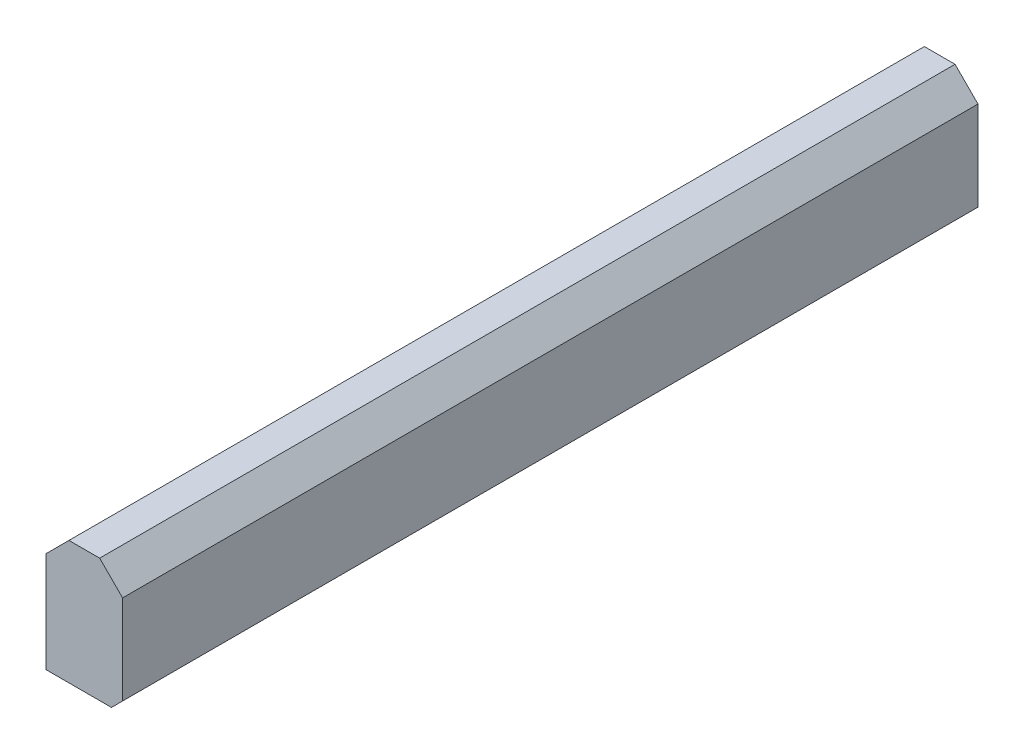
ISO-10303-21;
HEADER;
FILE_DESCRIPTION(('STEP AP214'),'2;1');
FILE_NAME('part.step','',(''),(''),'','','');
FILE_SCHEMA(('AUTOMOTIVE_DESIGN { 1 0 10303 214 1 1 1 1 }'));
ENDSEC;
DATA;
#1=APPLICATION_CONTEXT('core data for automotive mechanical design processes');
#2=APPLICATION_PROTOCOL_DEFINITION('international standard','automotive_design',2000,#1);
#3=PRODUCT_CONTEXT('',#1,'mechanical');
#4=PRODUCT('Part','Part','',(#3));
#5=PRODUCT_RELATED_PRODUCT_CATEGORY('part','',(#4));
#6=PRODUCT_DEFINITION_FORMATION('','',#4);
#7=PRODUCT_DEFINITION_CONTEXT('part definition',#1,'design');
#8=PRODUCT_DEFINITION('design','',#6,#7);
#9=PRODUCT_DEFINITION_SHAPE('','',#8);
#10=(LENGTH_UNIT() NAMED_UNIT(*) SI_UNIT(.MILLI.,.METRE.));
#11=(NAMED_UNIT(*) PLANE_ANGLE_UNIT() SI_UNIT($,.RADIAN.));
#12=(NAMED_UNIT(*) SI_UNIT($,.STERADIAN.) SOLID_ANGLE_UNIT());
#13=UNCERTAINTY_MEASURE_WITH_UNIT(LENGTH_MEASURE(1.E-05),#10,'distance_accuracy_value','');
#14=(GEOMETRIC_REPRESENTATION_CONTEXT(3) GLOBAL_UNCERTAINTY_ASSIGNED_CONTEXT((#13)) GLOBAL_UNIT_ASSIGNED_CONTEXT((#10,
#11,#12)) REPRESENTATION_CONTEXT('',''));
#15=CARTESIAN_POINT('',(0.,0.,0.));
#16=DIRECTION('',(0.,0.,1.));
#17=DIRECTION('',(1.,0.,0.));
#18=AXIS2_PLACEMENT_3D('',#15,#16,#17);
#19=CARTESIAN_POINT('',(-58.42,94.107,652.28397766));
#20=DIRECTION('',(0.,-1.,0.));
#21=DIRECTION('',(1.,0.,0.));
#22=AXIS2_PLACEMENT_3D('',#19,#20,#21);
#23=PLANE('',#22);
#24=DIRECTION('',(-1.,0.,0.));
#25=VECTOR('',#24,1.);
#26=CARTESIAN_POINT('',(-58.42,94.107,-652.28397766));
#27=LINE('',#26,#25);
#28=CARTESIAN_POINT('',(23.4200000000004,94.107,-652.28397766));
#29=VERTEX_POINT('',#28);
#30=CARTESIAN_POINT('',(-23.42,94.107,-652.28397766));
#31=VERTEX_POINT('',#30);
#32=EDGE_CURVE('E141',#29,#31,#27,.T.);
#33=ORIENTED_EDGE('',*,*,#32,.T.);
#34=DIRECTION('',(0.,0.,1.));
#35=VECTOR('',#34,1.);
#36=CARTESIAN_POINT('',(-23.42,94.107,652.28397766));
#37=LINE('',#36,#35);
#38=CARTESIAN_POINT('',(-23.42,94.107,652.28397766));
#39=VERTEX_POINT('',#38);
#40=EDGE_CURVE('E68',#31,#39,#37,.T.);
#41=ORIENTED_EDGE('',*,*,#40,.T.);
#42=DIRECTION('',(-1.,0.,0.));
#43=VECTOR('',#42,1.);
#44=CARTESIAN_POINT('',(-58.42,94.107,652.28397766));
#45=LINE('',#44,#43);
#46=CARTESIAN_POINT('',(23.4200000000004,94.107,652.28397766));
#47=VERTEX_POINT('',#46);
#48=EDGE_CURVE('E119',#47,#39,#45,.T.);
#49=ORIENTED_EDGE('',*,*,#48,.F.);
#50=DIRECTION('',(0.,0.,-1.));
#51=VECTOR('',#50,1.);
#52=CARTESIAN_POINT('',(23.4200000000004,94.107,652.28397766));
#53=LINE('',#52,#51);
#54=EDGE_CURVE('E173',#47,#29,#53,.T.);
#55=ORIENTED_EDGE('',*,*,#54,.T.);
#56=EDGE_LOOP('',(#33,#41,#49,#55));
#57=FACE_BOUND('',#56,.T.);
#58=ADVANCED_FACE('F46',(#57),#23,.F.);
#59=CARTESIAN_POINT('',(-58.42,-94.107,652.28397766));
#60=DIRECTION('',(1.,0.,0.));
#61=DIRECTION('',(0.,0.,-1.));
#62=AXIS2_PLACEMENT_3D('',#59,#60,#61);
#63=PLANE('',#62);
#64=DIRECTION('',(0.,-1.,0.));
#65=VECTOR('',#64,1.);
#66=CARTESIAN_POINT('',(-58.42,-94.107,652.28397766));
#67=LINE('',#66,#65);
#68=CARTESIAN_POINT('',(-58.42,59.107,652.28397766));
#69=VERTEX_POINT('',#68);
#70=CARTESIAN_POINT('',(-58.42,-94.107,652.28397766));
#71=VERTEX_POINT('',#70);
#72=EDGE_CURVE('E108',#69,#71,#67,.T.);
#73=ORIENTED_EDGE('',*,*,#72,.F.);
#74=DIRECTION('',(0.,0.,-1.));
#75=VECTOR('',#74,1.);
#76=CARTESIAN_POINT('',(-58.42,59.107,652.28397766));
#77=LINE('',#76,#75);
#78=CARTESIAN_POINT('',(-58.42,59.107,-652.28397766));
#79=VERTEX_POINT('',#78);
#80=EDGE_CURVE('E164',#69,#79,#77,.T.);
#81=ORIENTED_EDGE('',*,*,#80,.T.);
#82=DIRECTION('',(0.,-1.,0.));
#83=VECTOR('',#82,1.);
#84=CARTESIAN_POINT('',(-58.42,-94.107,-652.28397766));
#85=LINE('',#84,#83);
#86=CARTESIAN_POINT('',(-58.42,-94.107,-652.28397766));
#87=VERTEX_POINT('',#86);
#88=EDGE_CURVE('E127',#79,#87,#85,.T.);
#89=ORIENTED_EDGE('',*,*,#88,.T.);
#90=DIRECTION('',(0.,0.,-1.));
#91=VECTOR('',#90,1.);
#92=CARTESIAN_POINT('',(-58.42,-94.107,652.28397766));
#93=LINE('',#92,#91);
#94=EDGE_CURVE('E122',#71,#87,#93,.T.);
#95=ORIENTED_EDGE('',*,*,#94,.F.);
#96=EDGE_LOOP('',(#73,#81,#89,#95));
#97=FACE_BOUND('',#96,.T.);
#98=ADVANCED_FACE('F123',(#97),#63,.F.);
#99=CARTESIAN_POINT('',(-58.42,-94.107,652.28397766));
#100=DIRECTION('',(0.,1.,0.));
#101=DIRECTION('',(-1.,0.,0.));
#102=AXIS2_PLACEMENT_3D('',#99,#100,#101);
#103=PLANE('',#102);
#104=DIRECTION('',(1.,0.,0.));
#105=VECTOR('',#104,1.);
#106=CARTESIAN_POINT('',(-58.42,-94.107,-652.28397766));
#107=LINE('',#106,#105);
#108=CARTESIAN_POINT('',(41.4199999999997,-94.107,-652.28397766));
#109=VERTEX_POINT('',#108);
#110=EDGE_CURVE('E146',#87,#109,#107,.T.);
#111=ORIENTED_EDGE('',*,*,#110,.T.);
#112=DIRECTION('',(0.,0.,1.));
#113=VECTOR('',#112,1.);
#114=CARTESIAN_POINT('',(41.4199999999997,-94.107,652.28397766));
#115=LINE('',#114,#113);
#116=CARTESIAN_POINT('',(41.4199999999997,-94.107,652.28397766));
#117=VERTEX_POINT('',#116);
#118=EDGE_CURVE('E136',#109,#117,#115,.T.);
#119=ORIENTED_EDGE('',*,*,#118,.T.);
#120=DIRECTION('',(1.,0.,0.));
#121=VECTOR('',#120,1.);
#122=CARTESIAN_POINT('',(-58.42,-94.107,652.28397766));
#123=LINE('',#122,#121);
#124=EDGE_CURVE('E114',#71,#117,#123,.T.);
#125=ORIENTED_EDGE('',*,*,#124,.F.);
#126=ORIENTED_EDGE('',*,*,#94,.T.);
#127=EDGE_LOOP('',(#111,#119,#125,#126));
#128=FACE_BOUND('',#127,.T.);
#129=ADVANCED_FACE('F133',(#128),#103,.F.);
#130=CARTESIAN_POINT('',(58.42,-94.107,652.28397766));
#131=DIRECTION('',(-1.,0.,0.));
#132=DIRECTION('',(0.,0.,1.));
#133=AXIS2_PLACEMENT_3D('',#130,#131,#132);
#134=PLANE('',#133);
#135=DIRECTION('',(0.,1.,0.));
#136=VECTOR('',#135,1.);
#137=CARTESIAN_POINT('',(58.42,-94.107,-652.28397766));
#138=LINE('',#137,#136);
#139=CARTESIAN_POINT('',(58.42,-77.1069999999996,-652.28397766));
#140=VERTEX_POINT('',#139);
#141=CARTESIAN_POINT('',(58.42,59.1070000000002,-652.28397766));
#142=VERTEX_POINT('',#141);
#143=EDGE_CURVE('E151',#140,#142,#138,.T.);
#144=ORIENTED_EDGE('',*,*,#143,.T.);
#145=DIRECTION('',(0.,0.,1.));
#146=VECTOR('',#145,1.);
#147=CARTESIAN_POINT('',(58.42,59.1070000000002,652.28397766));
#148=LINE('',#147,#146);
#149=CARTESIAN_POINT('',(58.42,59.1070000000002,652.28397766));
#150=VERTEX_POINT('',#149);
#151=EDGE_CURVE('E11',#142,#150,#148,.T.);
#152=ORIENTED_EDGE('',*,*,#151,.T.);
#153=DIRECTION('',(0.,1.,0.));
#154=VECTOR('',#153,1.);
#155=CARTESIAN_POINT('',(58.42,-94.107,652.28397766));
#156=LINE('',#155,#154);
#157=CARTESIAN_POINT('',(58.42,-77.1069999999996,652.28397766));
#158=VERTEX_POINT('',#157);
#159=EDGE_CURVE('E135',#158,#150,#156,.T.);
#160=ORIENTED_EDGE('',*,*,#159,.F.);
#161=DIRECTION('',(0.,0.,-1.));
#162=VECTOR('',#161,1.);
#163=CARTESIAN_POINT('',(58.42,-77.1069999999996,652.28397766));
#164=LINE('',#163,#162);
#165=EDGE_CURVE('E131',#158,#140,#164,.T.);
#166=ORIENTED_EDGE('',*,*,#165,.T.);
#167=EDGE_LOOP('',(#144,#152,#160,#166));
#168=FACE_BOUND('',#167,.T.);
#169=ADVANCED_FACE('F191',(#168),#134,.F.);
#170=CARTESIAN_POINT('',(0.,0.,652.28397766));
#171=DIRECTION('',(0.,0.,1.));
#172=DIRECTION('',(1.,0.,0.));
#173=AXIS2_PLACEMENT_3D('',#170,#171,#172);
#174=PLANE('',#173);
#175=ORIENTED_EDGE('',*,*,#48,.T.);
#176=DIRECTION('',(0.707106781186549,0.707106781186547,0.));
#177=VECTOR('',#176,1.);
#178=CARTESIAN_POINT('',(-58.7634999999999,58.7635000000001,652.28397766));
#179=LINE('',#178,#177);
#180=EDGE_CURVE('E57',#39,#69,#179,.F.);
#181=ORIENTED_EDGE('',*,*,#180,.T.);
#182=ORIENTED_EDGE('',*,*,#72,.T.);
#183=ORIENTED_EDGE('',*,*,#124,.T.);
#184=DIRECTION('',(-0.707106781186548,-0.707106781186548,0.));
#185=VECTOR('',#184,1.);
#186=CARTESIAN_POINT('',(67.7634999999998,-67.7634999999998,652.28397766));
#187=LINE('',#186,#185);
#188=EDGE_CURVE('E165',#117,#158,#187,.F.);
#189=ORIENTED_EDGE('',*,*,#188,.T.);
#190=ORIENTED_EDGE('',*,*,#159,.T.);
#191=DIRECTION('',(0.707106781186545,-0.70710678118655,0.));
#192=VECTOR('',#191,1.);
#193=CARTESIAN_POINT('',(58.7635000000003,58.7634999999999,652.28397766));
#194=LINE('',#193,#192);
#195=EDGE_CURVE('E179',#150,#47,#194,.F.);
#196=ORIENTED_EDGE('',*,*,#195,.T.);
#197=EDGE_LOOP('',(#175,#181,#182,#183,#189,#190,#196));
#198=FACE_BOUND('',#197,.T.);
#199=ADVANCED_FACE('F112',(#198),#174,.T.);
#200=CARTESIAN_POINT('',(0.,0.,-652.28397766));
#201=DIRECTION('',(0.,0.,1.));
#202=DIRECTION('',(1.,0.,0.));
#203=AXIS2_PLACEMENT_3D('',#200,#201,#202);
#204=PLANE('',#203);
#205=ORIENTED_EDGE('',*,*,#88,.F.);
#206=DIRECTION('',(-0.707106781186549,-0.707106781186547,0.));
#207=VECTOR('',#206,1.);
#208=CARTESIAN_POINT('',(-58.42,59.107,-652.28397766));
#209=LINE('',#208,#207);
#210=EDGE_CURVE('E171',#79,#31,#209,.F.);
#211=ORIENTED_EDGE('',*,*,#210,.T.);
#212=ORIENTED_EDGE('',*,*,#32,.F.);
#213=DIRECTION('',(-0.707106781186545,0.70710678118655,0.));
#214=VECTOR('',#213,1.);
#215=CARTESIAN_POINT('',(23.4200000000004,94.107,-652.28397766));
#216=LINE('',#215,#214);
#217=EDGE_CURVE('E169',#29,#142,#216,.F.);
#218=ORIENTED_EDGE('',*,*,#217,.T.);
#219=ORIENTED_EDGE('',*,*,#143,.F.);
#220=DIRECTION('',(0.707106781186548,0.707106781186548,0.));
#221=VECTOR('',#220,1.);
#222=CARTESIAN_POINT('',(58.42,-77.1069999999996,-652.28397766));
#223=LINE('',#222,#221);
#224=EDGE_CURVE('E160',#140,#109,#223,.F.);
#225=ORIENTED_EDGE('',*,*,#224,.T.);
#226=ORIENTED_EDGE('',*,*,#110,.F.);
#227=EDGE_LOOP('',(#205,#211,#212,#218,#219,#225,#226));
#228=FACE_BOUND('',#227,.T.);
#229=ADVANCED_FACE('F189',(#228),#204,.F.);
#230=CARTESIAN_POINT('',(58.42,-77.1069999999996,652.28397766));
#231=DIRECTION('',(-0.707106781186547,0.707106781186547,0.));
#232=DIRECTION('',(0.,0.,-1.));
#233=AXIS2_PLACEMENT_3D('',#230,#231,#232);
#234=PLANE('',#233);
#235=ORIENTED_EDGE('',*,*,#188,.F.);
#236=ORIENTED_EDGE('',*,*,#118,.F.);
#237=ORIENTED_EDGE('',*,*,#224,.F.);
#238=ORIENTED_EDGE('',*,*,#165,.F.);
#239=EDGE_LOOP('',(#235,#236,#237,#238));
#240=FACE_BOUND('',#239,.T.);
#241=ADVANCED_FACE('F193',(#240),#234,.F.);
#242=CARTESIAN_POINT('',(-58.42,59.107,652.28397766));
#243=DIRECTION('',(0.707106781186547,-0.707106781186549,0.));
#244=DIRECTION('',(0.,0.,-1.));
#245=AXIS2_PLACEMENT_3D('',#242,#243,#244);
#246=PLANE('',#245);
#247=ORIENTED_EDGE('',*,*,#180,.F.);
#248=ORIENTED_EDGE('',*,*,#40,.F.);
#249=ORIENTED_EDGE('',*,*,#210,.F.);
#250=ORIENTED_EDGE('',*,*,#80,.F.);
#251=EDGE_LOOP('',(#247,#248,#249,#250));
#252=FACE_BOUND('',#251,.T.);
#253=ADVANCED_FACE('F198',(#252),#246,.F.);
#254=CARTESIAN_POINT('',(23.4200000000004,94.107,652.28397766));
#255=DIRECTION('',(-0.70710678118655,-0.707106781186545,0.));
#256=DIRECTION('',(0.,0.,-1.));
#257=AXIS2_PLACEMENT_3D('',#254,#255,#256);
#258=PLANE('',#257);
#259=ORIENTED_EDGE('',*,*,#195,.F.);
#260=ORIENTED_EDGE('',*,*,#151,.F.);
#261=ORIENTED_EDGE('',*,*,#217,.F.);
#262=ORIENTED_EDGE('',*,*,#54,.F.);
#263=EDGE_LOOP('',(#259,#260,#261,#262));
#264=FACE_BOUND('',#263,.T.);
#265=ADVANCED_FACE('F47',(#264),#258,.F.);
#266=CLOSED_SHELL('',(#58,#98,#129,#169,#199,#229,#241,#253,#265));
#267=MANIFOLD_SOLID_BREP('B2',#266);
#268=ADVANCED_BREP_SHAPE_REPRESENTATION('',(#18,#267),#14);
#269=SHAPE_DEFINITION_REPRESENTATION(#9,#268);
ENDSEC;
END-ISO-10303-21;
